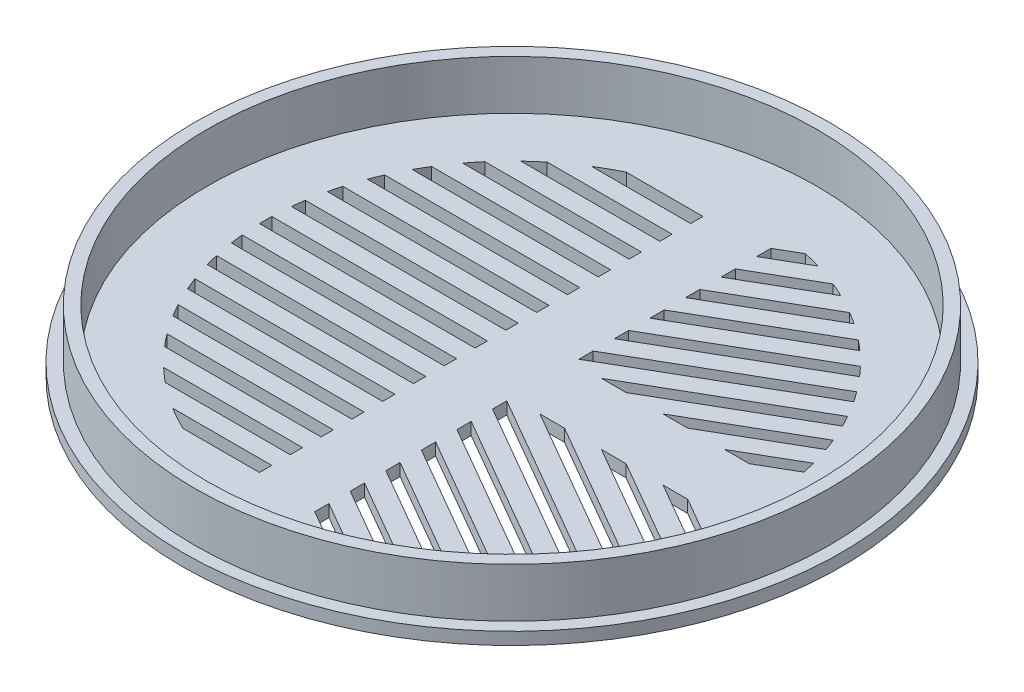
from build123d import *

# Parameters (mm, degrees)
SKETCH2_R              = 53.5
BASEPLATE_DEPTH        = 2
SLITS_HORIZONTAL_DEPTH = 10
SLITS_ANGLED_DEPTH     = 10
SKETCH3_R              = 51.5
SKETCH3_R_2            = 49.5
COLLAR_DEPTH           = 8


with BuildPart() as part:
    # Sketch2 → BasePlate (new body)
    with BuildSketch(Plane(origin=(0, 0, 0), x_dir=(1, 0, 0), z_dir=(0, 1, 0))):
        with Locations(Location((0, 0, 0), (0, 0, 270))):
            Circle(SKETCH2_R)
    extrude(amount=BASEPLATE_DEPTH)

    # Horizontal Slit Cuts → Slits - Horizontal (cut, symmetric)
    with BuildSketch(Plane(origin=(0, 0, 0), x_dir=(1, 0, 0), z_dir=(0, 1, 0))):
        with BuildLine():
            Line((-21.071307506, 34), (-5, 34))
            Line((-5, 34), (-5, 36))
            Line((-5, 36), (-17.435595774, 36))
            ThreePointArc((-17.435595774, 36), (-19.279403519, 35.047176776), (-21.071307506, 34))
        make_face()
        with BuildLine():
            Line((-27.549954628, 29), (-5, 29))
            Line((-5, 29), (-5, 31))
            Line((-5, 31), (-25.27844932, 31))
            ThreePointArc((-25.27844932, 31), (-26.433124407, 30.021491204), (-27.549954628, 29))
        make_face()
        with BuildLine():
            Line((-5, -4), (-5, -6))
            Line((-5, -6), (-39.547439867, -6))
            ThreePointArc((-39.547439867, -6), (-39.686069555, -5.001588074), (-39.799497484, -4))
            Line((-39.799497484, -4), (-5, -4))
        make_face()
        with BuildLine():
            Line((-32, 24), (-5, 24))
            Line((-5, 24), (-5, 26))
            Line((-5, 26), (-30.397368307, 26))
            ThreePointArc((-30.397368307, 26), (-31.214706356, 25.012838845), (-32, 24))
        make_face()
        with BuildLine():
            Line((-5, -9), (-5, -11))
            Line((-5, -11), (-38.457769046, -11))
            ThreePointArc((-38.457769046, -11), (-38.728972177, -10.003335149), (-38.97435054, -9))
            Line((-38.97435054, -9), (-5, -9))
        make_face()
        with BuildLine():
            Line((-35.199431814, 19), (-5, 19))
            Line((-5, 19), (-5, 21))
            Line((-5, 21), (-34.044089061, 21))
            ThreePointArc((-34.044089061, 21), (-34.636199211, 20.008340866), (-35.199431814, 19))
        make_face()
        with BuildLine():
            Line((-5, -14), (-5, -16))
            Line((-5, -16), (-36.66060556, -16))
            ThreePointArc((-36.66060556, -16), (-37.078784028, -15.005458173), (-37.46998799, -14))
            Line((-37.46998799, -14), (-5, -14))
        make_face()
        with BuildLine():
            Line((-37.46998799, 14), (-5, 14))
            Line((-5, 14), (-5, 16))
            Line((-5, 16), (-36.66060556, 16))
            ThreePointArc((-36.66060556, 16), (-37.078784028, 15.005458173), (-37.46998799, 14))
        make_face()
        with BuildLine():
            Line((-5, -19), (-5, -21))
            Line((-5, -21), (-34.044089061, -21))
            ThreePointArc((-34.044089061, -21), (-34.636199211, -20.008340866), (-35.199431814, -19))
            Line((-35.199431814, -19), (-5, -19))
        make_face()
        with BuildLine():
            Line((-38.97435054, 9), (-5, 9))
            Line((-5, 9), (-5, 11))
            Line((-5, 11), (-38.457769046, 11))
            ThreePointArc((-38.457769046, 11), (-38.728972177, 10.003335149), (-38.97435054, 9))
        make_face()
        with BuildLine():
            Line((-5, -24), (-5, -26))
            Line((-5, -26), (-30.397368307, -26))
            ThreePointArc((-30.397368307, -26), (-31.214706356, -25.012838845), (-32, -24))
            Line((-32, -24), (-5, -24))
        make_face()
        with BuildLine():
            Line((-5, -29), (-5, -31))
            Line((-5, -31), (-25.27844932, -31))
            ThreePointArc((-25.27844932, -31), (-26.433124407, -30.021491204), (-27.549954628, -29))
            Line((-27.549954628, -29), (-5, -29))
        make_face()
        with BuildLine():
            Line((-39.799497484, 4), (-5, 4))
            Line((-5, 4), (-5, 6))
            Line((-5, 6), (-39.547439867, 6))
            ThreePointArc((-39.547439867, 6), (-39.686069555, 5.001588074), (-39.799497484, 4))
        make_face()
        with BuildLine():
            Line((-5, -34), (-5, -36))
            Line((-5, -36), (-17.435595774, -36))
            ThreePointArc((-17.435595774, -36), (-19.279403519, -35.047176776), (-21.071307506, -34))
            Line((-21.071307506, -34), (-5, -34))
        make_face()
        with BuildLine():
            Line((-39.987498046, -1), (-5, -1))
            Line((-5, -1), (-5, 1))
            Line((-5, 1), (-39.987498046, 1))
            ThreePointArc((-39.987498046, 1), (-40, 0), (-39.987498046, -1))
        make_face()
    extrude(amount=SLITS_HORIZONTAL_DEPTH, both=True, mode=Mode.SUBTRACT)

    # Angled Slit Cuts → Slits - Angled (cut, symmetric)
    with BuildSketch(Plane(origin=(0, 0, 0), x_dir=(1, 0, 0), z_dir=(0, 1, 0))):
        with BuildLine():
            Line((5, 37.027767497), (8.54770749, 39.076037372))
            ThreePointArc((8.54770749, 39.076037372), (9.938814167, 38.745580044), (11.317221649, 38.36561604))
            Line((11.317221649, 38.36561604), (5, 34.718366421))
            Line((5, 34.718366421), (5, 37.027767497))
        make_face()
        with BuildLine():
            Line((5, 31.254264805), (5, 28.944863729))
            Line((5, 28.944863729), (17.318050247, 36.056693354))
            ThreePointArc((17.318050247, 36.056693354), (16.193862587, 36.575385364), (15.05416081, 37.059037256))
            Line((15.05416081, 37.059037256), (5, 31.254264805))
        make_face()
        with BuildLine():
            Line((5, 25.480762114), (5, 23.171361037))
            Line((5, 23.171361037), (22.338053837, 33.181491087))
            ThreePointArc((22.338053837, 33.181491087), (21.392506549, 33.798826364), (20.429909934, 34.389224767))
            Line((20.429909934, 34.389224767), (5, 25.480762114))
        make_face()
        with BuildLine():
            Line((5, 19.707259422), (5, 17.397858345))
            Line((5, 17.397858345), (26.603481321, 29.870634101))
            ThreePointArc((26.603481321, 29.870634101), (25.800227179, 30.567111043), (24.978746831, 31.241994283))
            Line((24.978746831, 31.241994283), (5, 19.707259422))
        make_face()
        with BuildLine():
            Line((5, 13.93375673), (5, 11.624355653))
            Line((5, 11.624355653), (30.232025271, 26.192072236))
            ThreePointArc((30.232025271, 26.192072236), (29.551753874, 26.95725956), (28.852120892, 27.704785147))
            Line((28.852120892, 27.704785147), (5, 13.93375673))
        make_face()
        with BuildLine():
            Line((33.526279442, 5), (29.526279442, 5))
            Line((29.526279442, 5), (38.658458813, 10.272466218))
            ThreePointArc((38.658458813, 10.272466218), (38.913300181, 9.260403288), (39.141650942, 8.242036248))
            Line((39.141650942, 8.242036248), (33.526279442, 5))
        make_face()
        with BuildLine():
            Line((5, 8.160254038), (5, 5.850852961))
            Line((5, 5.850852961), (33.286116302, 22.181849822))
            ThreePointArc((33.286116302, 22.181849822), (32.718863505, 23.010344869), (32.130994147, 23.824340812))
            Line((32.130994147, 23.824340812), (5, 8.160254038))
        make_face()
        with BuildLine():
            Line((13.526279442, 5), (9.526279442, 5))
            Line((9.526279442, 5), (34.855492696, 19.623828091))
            ThreePointArc((34.855492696, 19.623828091), (35.335495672, 18.745739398), (35.793382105, 17.855917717))
            Line((35.793382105, 17.855917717), (13.526279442, 5))
        make_face()
        with BuildLine():
            Line((23.526279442, 5), (19.526279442, 5))
            Line((19.526279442, 5), (37.036497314, 15.109529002))
            ThreePointArc((37.036497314, 15.109529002), (37.407337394, 14.166548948), (37.754172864, 13.214478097))
            Line((37.754172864, 13.214478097), (23.526279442, 5))
        make_face()
    slits_angled = extrude(amount=SLITS_ANGLED_DEPTH, both=True, mode=Mode.SUBTRACT)

    # Mirror1: Slits - Angled across plane
    add(slits_angled.mirror(Plane.XY), mode=Mode.SUBTRACT)

    # Sketch3 → Collar (add)
    with BuildSketch(Plane(origin=(0, 2, 0), x_dir=(1, 0, 0), z_dir=(0, 1, 0))):
        with Locations(Location((0, 0, 0), (0, 0, 270))):
            Circle(SKETCH3_R)
        with Locations(Location((0, 0, 0), (0, 0, 270))):
            Circle(SKETCH3_R_2, mode=Mode.SUBTRACT)
    extrude(amount=COLLAR_DEPTH)


solid = part.part
